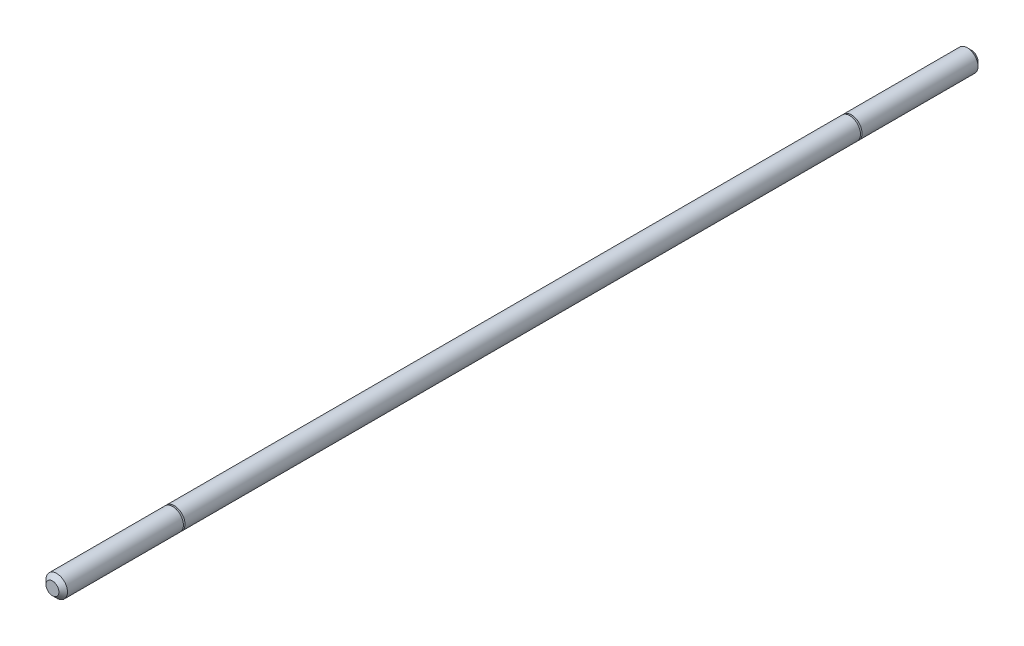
from build123d import *

# Parameters (mm, degrees)
SKETCH1_R                   = 7.9375
EXTRUDE1_DEPTH              = 339.725
CHAMFER1_SIZE               = 3.175
SKETCH4_OUTSIDE_W           = 153.838
SKETCH4_OUTSIDE_H           = 153.838
SKETCH4_OUTSIDE_R           = 6.1595
RETAINING_RING_GROOVE_DEPTH = 1.1684


with BuildPart() as part:
    # Sketch1 → Extrude1 (new, symmetric)
    with BuildSketch(Plane.XY):
        Circle(SKETCH1_R)
    extrude(amount=EXTRUDE1_DEPTH, both=True)

    # Chamfer1
    chamfer1_edges = [part.edges().sort_by_distance(p)[0] for p in [
        (-7.9375, 0, -339.725),
        (-7.9375, 0, 339.725),
    ]]
    chamfer(chamfer1_edges, length=CHAMFER1_SIZE)

    # Sketch4 outside → Retaining Ring Groove (cut)
    with BuildSketch(Plane.XY.offset(250.825)):
        Rectangle(SKETCH4_OUTSIDE_W, SKETCH4_OUTSIDE_H)
        Circle(SKETCH4_OUTSIDE_R, mode=Mode.SUBTRACT)
    retaining_ring_groove = extrude(amount=-RETAINING_RING_GROOVE_DEPTH, mode=Mode.SUBTRACT)

    # Mirror1: Retaining Ring Groove across plane
    add(retaining_ring_groove.mirror(Plane.XY), mode=Mode.SUBTRACT)


solid = part.part
